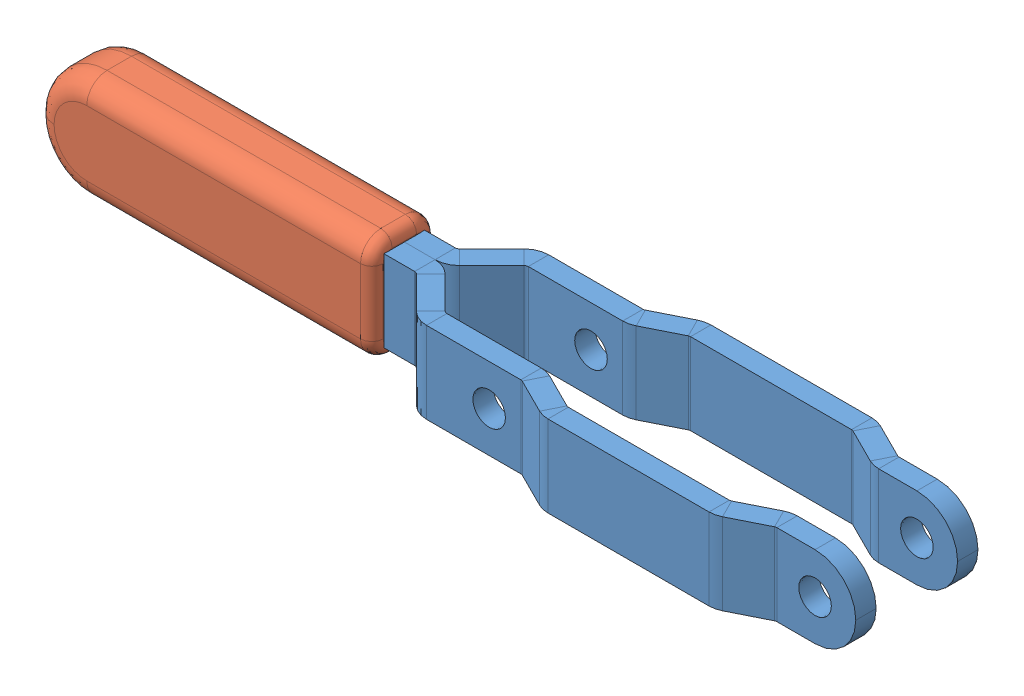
SolidWorks assembly handle sub-assy_&.sldasm, configuration Default (file format 8000). Lengths in mm.
Overall size (132.59 16.51 25.4).
3 component instances, 2 part files, 5 mates.
Components (placement in the parent):
- handle-half_&-1: handle-half_&.SLDPRT [Default] at (2.3468 22.924 12.7) size (130.68 12.7 12.7)
- handle-half_&-2: handle-half_&.SLDPRT [Default] at (2.3468 35.624 0) x (1 0 0) z (0 0 -1) size (130.68 12.7 12.7)
- sleeve_&-1: sleeve_&.sldprt [Default] at (-128.3362 22.924 3.175) size (52.77 16.51 10.16)
Mates (geometry in assembly coordinates):
- MateConcentric1: concentric anti-aligned: cylinder of handle-half_&-1 through (-4.0032 29.274 6.35) axis (0 0 1) radius 2.54; cylinder of handle-half_&-2 through (-4.0032 29.274 6.35) axis (0 0 -1) radius 2.54
- MateCoincident2: coincident anti-aligned: plane of handle-half_&-1 through (-71.1862 35.624 6.35) normal (0 0 -1); plane of handle-half_&-2 through (-71.1862 22.924 6.35) normal (0 0 1)
- MateConcentric5: concentric anti-aligned: cylinder of handle-half_&-1 through (-54.8032 29.274 6.35) axis (0 0 1) radius 2.54; cylinder of handle-half_&-2 through (-54.8032 29.274 6.35) axis (0 0 -1) radius 2.54
- MateCoincident3: coincident aligned: line of handle-half_&-1 through (-72.7643 35.624 9.525) axis (-1 0 0); line of sleeve_&-1 through (-77.5816 35.624 9.525) axis (-1 0 0)
- MateCoincident4: coincident aligned: line of handle-half_&-1 through (-121.9862 35.624 6.35) axis (0 0 1); line of sleeve_&-1 through (-121.9862 35.624 3.175) axis (0 0 1)
